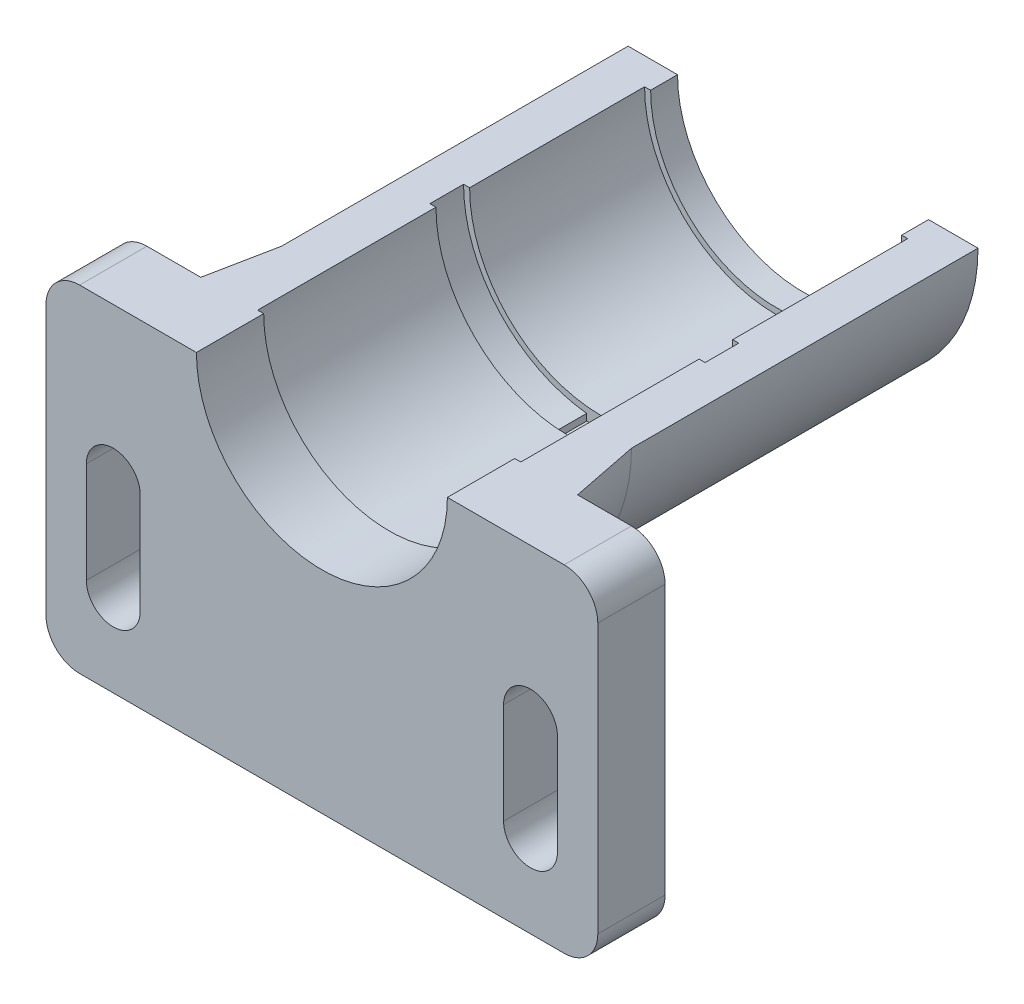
from build123d import *

# Parameters (mm, degrees)
BOSS_EXTRU_1_DEPTH      = 57.5
BOSS_EXTRU_2_DEPTH      = 10
ENL_V_START             = -26
ENL_V_MAT_EXTRU_1_DEPTH = 5
ENL_V_MAT_EXTRU_2_DEPTH = 94.473258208
BOSS_EXTRU_4_START      = 4
BOSS_EXTRU_4_DEPTH      = 4
CHANFREIN1_SIZE         = 10
CHANFREIN1_SIZE2        = 2
CONG_1_R                = 5


with BuildPart() as part:
    # Esquisse1 → Boss.-Extru.1 (new body)
    with BuildSketch(Plane.XY):
        with BuildLine():
            Line((-26, 0), (-19.55, 0))
            ThreePointArc((-19.55, 0), (0, -19.55), (19.55, 0))
            Line((19.55, 0), (26, 0))
            ThreePointArc((26, 0), (0, -26), (-26, 0))
        make_face()
    extrude(amount=BOSS_EXTRU_1_DEPTH)

    # Esquisse2 → Boss.-Extru.2 (add)
    with BuildSketch(Plane.XY.offset(57.5)):
        with BuildLine():
            Line((-41, 0), (-18.65, 0))
            ThreePointArc((-18.65, 0), (0, -18.65), (18.65, 0))
            Line((18.65, 0), (41, 0))
            Line((41, 0), (41, -50))
            Line((41, -50), (-41, -50))
            Line((-41, -50), (-41, 0))
        make_face()
    extrude(amount=BOSS_EXTRU_2_DEPTH)

    # Esquisse5 → Enl_v. mat.-Extru.1 (cut)
    with BuildSketch(Plane(origin=(0, 0, 0), x_dir=(-1, 0, 0), z_dir=(0, 0, -1)).offset(ENL_V_START)):
        with BuildLine():
            ThreePointArc((2.15, -20.336666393), (15.201480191, -13.679089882), (20.45, 0))
            Line((20.45, 0), (19.55, 0))
            ThreePointArc((19.55, 0), (0, -19.55), (-19.55, 0))
            Line((-19.55, 0), (-20.45, 0))
            ThreePointArc((-20.45, 0), (-15.201480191, -13.679089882), (-2.15, -20.336666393))
            ThreePointArc((-2.15, -20.336666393), (0, -20.45), (2.15, -20.336666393))
        make_face()
        with BuildLine():
            Line((2.15, -21.336666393), (2.15, -20.336666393))
            ThreePointArc((2.15, -20.336666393), (0, -20.45), (-2.15, -20.336666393))
            Line((-2.15, -20.336666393), (-2.15, -21.336666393))
            Line((-2.15, -21.336666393), (2.15, -21.336666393))
        make_face()
    extrude(amount=-ENL_V_MAT_EXTRU_1_DEPTH, mode=Mode.SUBTRACT)

    # Esquisse6 → Enl_v. mat.-Extru.2 (cut, through all)
    with BuildSketch(Plane.XY.offset(67.5)):
        with BuildLine():
            Line((27, -37.5), (27, -22.5))
            ThreePointArc((27, -22.5), (31, -18.5), (35, -22.5))
            Line((35, -22.5), (35, -37.5))
            ThreePointArc((35, -37.5), (31, -41.5), (27, -37.5))
        make_face()
        with BuildLine():
            Line((-27, -37.5), (-27, -22.5))
            ThreePointArc((-27, -22.5), (-31, -18.5), (-35, -22.5))
            Line((-35, -22.5), (-35, -37.5))
            ThreePointArc((-35, -37.5), (-31, -41.5), (-27, -37.5))
        make_face()
    extrude(amount=-ENL_V_MAT_EXTRU_2_DEPTH, mode=Mode.SUBTRACT)

    # Esquisse4 → Boss.-Extru.4 (add)
    with BuildSketch(Plane(origin=(0, 0, 0), x_dir=(-1, 0, 0), z_dir=(0, 0, -1)).offset(BOSS_EXTRU_4_START)):
        with BuildLine():
            Line((-18.65, 0), (-26, 0))
            ThreePointArc((-26, 0), (0, -26), (26, 0))
            Line((26, 0), (18.65, 0))
            ThreePointArc((18.65, 0), (0, -18.65), (-18.65, 0))
        make_face()
    extrude(amount=-BOSS_EXTRU_4_DEPTH)

    # Chanfrein1
    chanfrein1_edges = [part.edges().sort_by_distance(p)[0] for p in [
        (0, -26, 57.5),
    ]]
    chanfrein1_side = [part.faces().sort_by_distance(p)[0] for p in [
        (0, -26, 26.75),
    ]]
    chamfer(chanfrein1_edges, length=CHANFREIN1_SIZE, length2=CHANFREIN1_SIZE2, reference=chanfrein1_side[0])

    # Cong_1
    cong_1_edges = [part.edges().sort_by_distance(p)[0] for p in [
        (-41, 0, 62.5),
        (-41, -50, 62.5),
        (41, -50, 62.5),
        (41, 0, 62.5),
    ]]
    fillet(cong_1_edges, radius=CONG_1_R)


solid = part.part
